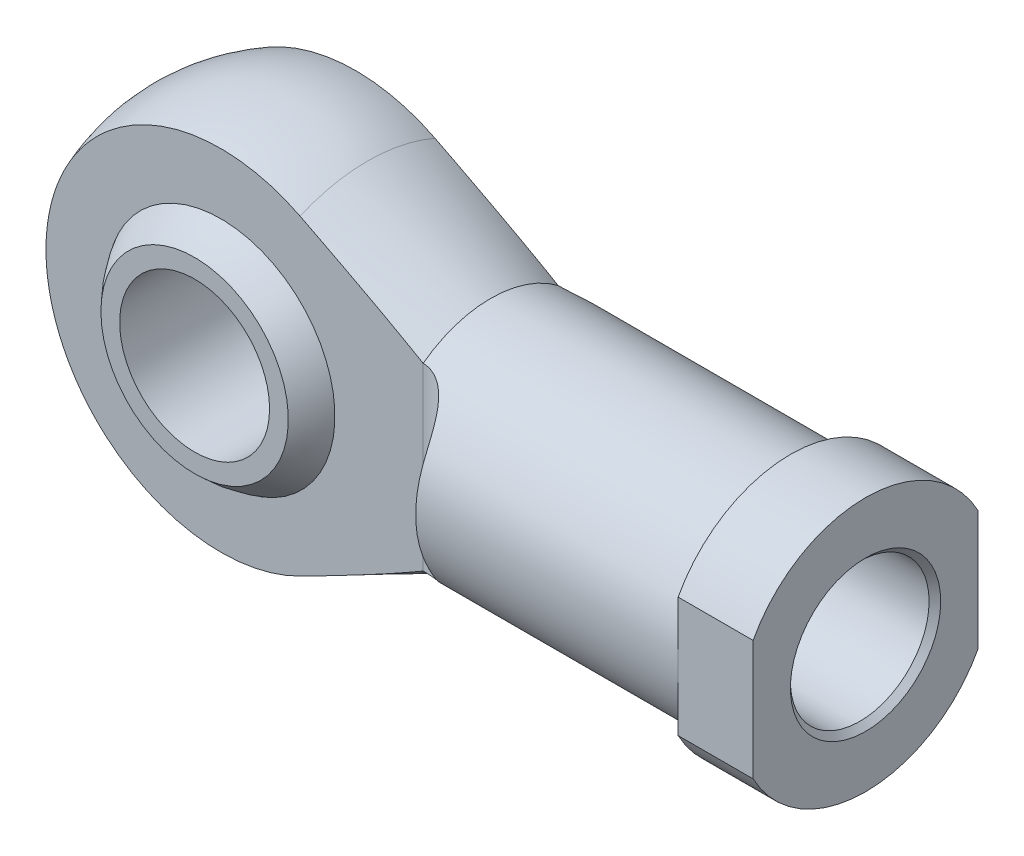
from build123d import *

# Parameters (mm, degrees)
CUT_EXTRUDE_1_DEPTH  = 119.549567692
SKETCH_8_OUTSIDE_W   = 59.714
SKETCH_8_OUTSIDE_H   = 75.714
SKETCH_8_OUTSIDE_W_2 = 30
SKETCH_8_OUTSIDE_H_2 = 50
CUT_EXTRUDE_3_DEPTH  = 15
SKETCH_12_R          = 10
CUT_EXTRUDE_4_DEPTH  = 25


with BuildPart() as part:
    # Sketch 1 → Revolve 1 (revolve)
    with BuildSketch(Plane.XY):
        with BuildLine():
            Line((0, 0), (0, 17))
            Line((0, 17), (-10, 17))
            Line((-10, 17), (-10, 15))
            Line((-10, 15), (-50.012564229, 15))
            Line((-50.012564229, 15), (-66.434543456, 22.657694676))
            ThreePointArc((-66.434543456, 22.657694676), (-90.432490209, 21.084786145), (-102, 0))
            Line((-102, 0), (0, 0))
        make_face()
    revolve(axis=Axis((0, 0, 0), (-1, 0, 0)))

    # Sketch 3 → Cut-Extrude 1 (cut, through all)
    with BuildSketch(Plane(origin=(0, 30, 0), x_dir=(1, 0, 0), z_dir=(0, 1, 0))):
        with BuildLine():
            Line((-102, -9), (-102, 9))
            Line((-102, 9), (-50.012564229, 9))
            ThreePointArc((-50.012564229, 9), (-46.477030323, 10.464466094), (-45.012564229, 14))
            Line((-45.012564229, 14), (-45.012564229, 30.37860674))
            Line((-45.012564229, 30.37860674), (-111.651909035, 30.37860674))
            Line((-111.651909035, 30.37860674), (-111.651909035, -30.37860674))
            Line((-111.651909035, -30.37860674), (-45.012564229, -30.37860674))
            Line((-45.012564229, -30.37860674), (-45.012564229, -14))
            ThreePointArc((-45.012564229, -14), (-46.477030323, -10.464466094), (-50.012564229, -9))
            Line((-50.012564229, -9), (-102, -9))
        make_face()
    extrude(amount=-CUT_EXTRUDE_1_DEPTH, mode=Mode.SUBTRACT)

    # Sketch 11 → Cut-Revolve 1 (revolve, cut)
    with BuildSketch(Plane(origin=(0, 0, 0), x_dir=(1, 0, 0), z_dir=(0, 1, 0))):
        with BuildLine():
            Line((-89.5, 12.5), (-77, 12.5))
            Line((-77, 12.5), (-77, -12.5))
            Line((-77, -12.5), (-89.5, -12.5))
            ThreePointArc((-89.5, -12.5), (-94.67766953, 0), (-89.5, 12.5))
        make_face()
    revolve(axis=Axis((-77, 0, -12.5), (0, 0, 1)), mode=Mode.SUBTRACT)

    # Sketch 8 outside → Cut-Extrude 3 (cut)
    with BuildSketch(Plane(origin=(0, 0, 0), x_dir=(0, 0, -1), z_dir=(1, 0, 0))):
        Rectangle(SKETCH_8_OUTSIDE_W, SKETCH_8_OUTSIDE_H)
        Rectangle(SKETCH_8_OUTSIDE_W_2, SKETCH_8_OUTSIDE_H_2, mode=Mode.SUBTRACT)
    extrude(amount=-CUT_EXTRUDE_3_DEPTH, mode=Mode.SUBTRACT)

    # Sketch 9 → Hole Wizard 0 (revolve, cut)
    with BuildSketch(Plane(origin=(0, 0, 0), x_dir=(0, 0, -1), z_dir=(0, 1, 0))):
        Polygon((0, 0), (0, 53.057960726), (9.25, 47.5), (9.25, 0.775), (10.025, 0), align=None)
    revolve(axis=Axis((6.35, 0, 0), (-1, 0, 0)), mode=Mode.SUBTRACT)


with BuildPart() as body_2:
    # Sketch 11_2 → Revolve 2 (revolve)
    with BuildSketch(Plane(origin=(0, 0, 0), x_dir=(1, 0, 0), z_dir=(0, 1, 0))):
        with BuildLine():
            Line((-89.5, 12.5), (-77, 12.5))
            Line((-77, 12.5), (-77, -12.5))
            Line((-77, -12.5), (-89.5, -12.5))
            ThreePointArc((-89.5, -12.5), (-94.67766953, 0), (-89.5, 12.5))
        make_face()
    revolve(axis=Axis((-77, 0, -12.5), (0, 0, 1)))

    # Sketch 12 → Cut-Extrude 4 (cut, symmetric)
    with BuildSketch(Plane.XY):
        with Locations((-77, 0)):
            Circle(SKETCH_12_R)
    extrude(amount=CUT_EXTRUDE_4_DEPTH, both=True, mode=Mode.SUBTRACT)


solid = Compound([part.part, body_2.part])
